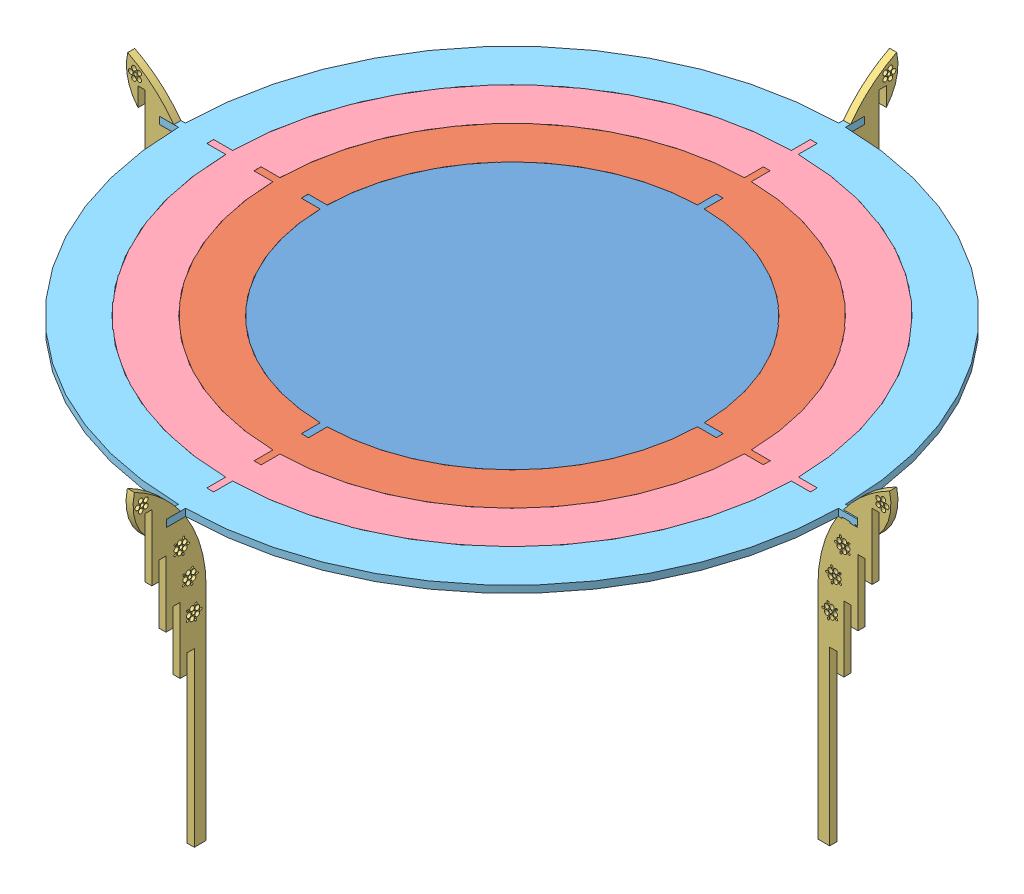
SolidWorks assembly Assem2.SLDASM, configuration Default (file format 7000). Lengths in mm.
Overall size (324.25 143.58 324.4).
8 component instances, 5 part files, 16 mates.
Components (placement in the parent):
- Part1-1: Part1.SLDPRT [Default] at (97.3564 84.0828 122.6066) size (175.97 3 175.97)
- Part2-1: Part2.SLDPRT [Default] at (97.3064 84.0828 122.6075) size (215.98 3 215.98)
- Part3-1: Part3.SLDPRT [Default] at (98.7064 99.0987 -33.1751) x (0 1 0) z (-1 0 0) size (143.05 30.95 3)
- Part4-1: Part4.SLDPRT [Default] at (97.2564 84.0828 122.6083) size (255.98 3 255.98)
- Part5-1: Part5.SLDPRT [Default] at (97.2064 84.0828 122.6089) size (295.98 3 295.98)
- Part3-2: Part3.SLDPRT [Default] at (252.9904 99.6212 124.1089) x (0 1 0) z (0 0 -1) size (143.05 30.95 3)
- Part3-3: Part3.SLDPRT [Default] at (-58.4276 99.0987 121.1089) x (0 1 0) z (0 0 1) size (143.05 30.95 3)
- Part3-4: Part3.SLDPRT [Default] at (95.7064 99.0987 278.3929) x (0 1 0) z (1 0 0) size (143.05 30.95 3)
Mates (geometry in assembly coordinates):
- Coincident1: coincident anti-aligned: plane of Part4-1 through (97.2564 87.0828 -5.3823) normal (0 0 -1); plane of Part5-1 through (97.2064 87.0828 -5.3823) normal (0 0 1)
- Coincident2: coincident anti-aligned: plane of Part4-1 through (95.7564 87.0828 122.6083) normal (-1 0 0); plane of Part5-1 through (95.7564 87.0828 122.6089) normal (1 0 0)
- Coincident3: coincident anti-aligned: plane of Part2-1 through (95.8064 87.0828 122.6075) normal (-1 0 0); plane of Part4-1 through (95.8064 87.0828 122.6083) normal (1 0 0)
- Coincident4: coincident anti-aligned: plane of Part2-1 through (97.3064 87.0828 14.6188) normal (0 0 -1); plane of Part4-1 through (97.2564 87.0828 14.6188) normal (0 0 1)
- Coincident5: coincident anti-aligned: plane of Part1-1 through (95.8564 87.0828 122.6066) normal (-1 0 0); plane of Part2-1 through (95.8564 87.0828 122.6075) normal (1 0 0)
- Coincident6: coincident anti-aligned: plane of Part1-1 through (97.3564 87.0828 34.6207) normal (0 0 -1); plane of Part2-1 through (97.3064 87.0828 34.6207) normal (0 0 1)
- Coincident7: coincident aligned: plane of Part1-1 through (97.3564 87.0828 122.6066) normal (0 1 0); plane of Part2-1 through (97.3064 87.0828 122.6075) normal (0 1 0)
- Coincident8: coincident aligned: plane of Part2-1 through (97.3064 87.0828 122.6075) normal (0 1 0); plane of Part4-1 through (97.2564 87.0828 122.6083) normal (0 1 0)
- Coincident9: coincident aligned: plane of Part4-1 through (97.2564 87.0828 122.6083) normal (0 1 0); plane of Part5-1 through (97.2064 87.0828 122.6089) normal (0 1 0)
- Coincident28: coincident aligned: plane of Part3-1 through (95.7064 54.1094 -64.3697) normal (-1 0 0); plane of Part5-1 through (95.7064 87.0828 122.6089) normal (-1 0 0)
- Coincident29: coincident anti-aligned: plane of Part3-1 through (95.7064 84.0828 -25.3831) normal (0 0 1); plane of Part5-1 through (97.2064 87.0828 -25.3831) normal (0 0 -1)
- Coincident31: coincident aligned: plane of Part5-1 through (95.7064 87.0828 122.6089) normal (-1 0 0); plane of Part3-4 through (95.7064 54.1094 309.5875) normal (-1 0 0)
- Coincident32: coincident anti-aligned: plane of Part5-1 through (97.2064 87.0828 270.6009) normal (0 0 1); plane of Part3-4 through (98.7064 84.0828 270.6009) normal (0 0 -1)
- Coincident33: coincident aligned: plane of Part5-1 through (97.2064 87.0828 121.1089) normal (0 0 -1); plane of Part3-2 through (284.185 54.632 121.1089) normal (0 0 -1)
- Coincident34: coincident anti-aligned: plane of Part5-1 through (245.1984 87.0828 122.6089) normal (1 0 0); plane of Part3-2 through (245.1984 84.6054 121.1089) normal (-1 0 0)
- Coincident37: coincident aligned: plane of Part5-1 through (97.2064 87.0828 124.1089) normal (0 0 1); plane of Part3-3 through (-89.6222 54.1094 124.1089) normal (0 0 1)
